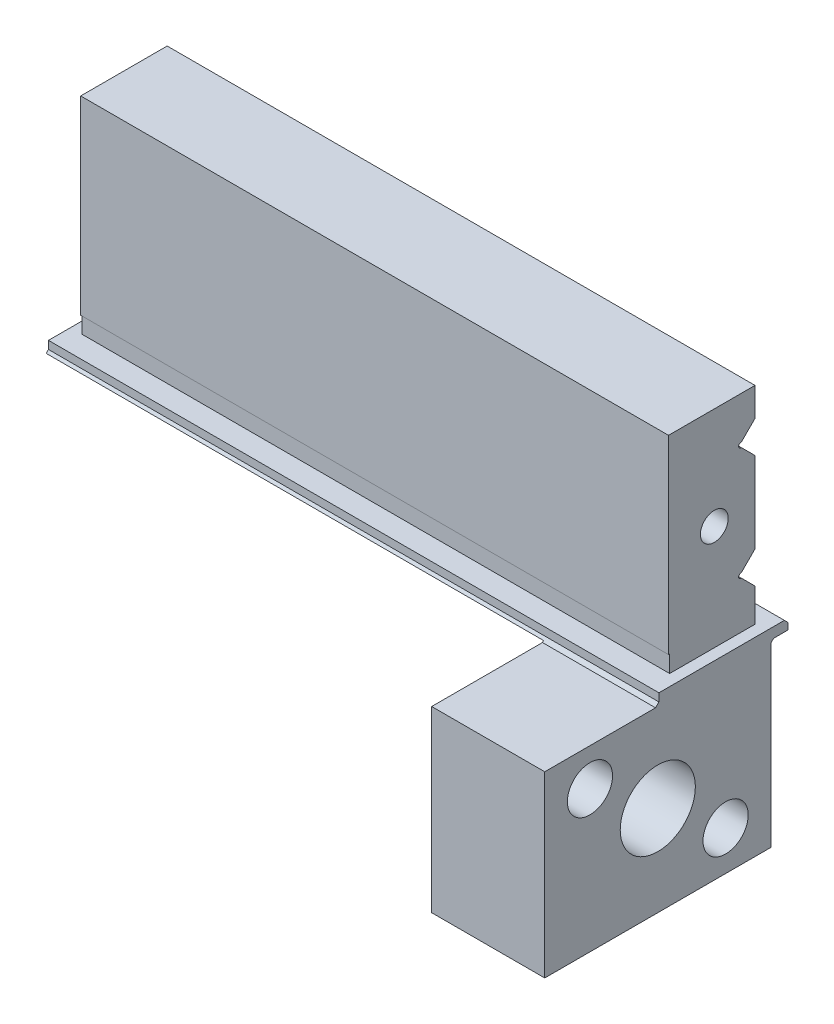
ISO-10303-21;
HEADER;
FILE_DESCRIPTION(('STEP AP214'),'2;1');
FILE_NAME('part.step','',(''),(''),'','','');
FILE_SCHEMA(('AUTOMOTIVE_DESIGN { 1 0 10303 214 1 1 1 1 }'));
ENDSEC;
DATA;
#1=APPLICATION_CONTEXT('core data for automotive mechanical design processes');
#2=APPLICATION_PROTOCOL_DEFINITION('international standard','automotive_design',2000,#1);
#3=PRODUCT_CONTEXT('',#1,'mechanical');
#4=PRODUCT('Part','Part','',(#3));
#5=PRODUCT_RELATED_PRODUCT_CATEGORY('part','',(#4));
#6=PRODUCT_DEFINITION_FORMATION('','',#4);
#7=PRODUCT_DEFINITION_CONTEXT('part definition',#1,'design');
#8=PRODUCT_DEFINITION('design','',#6,#7);
#9=PRODUCT_DEFINITION_SHAPE('','',#8);
#10=(LENGTH_UNIT() NAMED_UNIT(*) SI_UNIT(.MILLI.,.METRE.));
#11=(NAMED_UNIT(*) PLANE_ANGLE_UNIT() SI_UNIT($,.RADIAN.));
#12=(NAMED_UNIT(*) SI_UNIT($,.STERADIAN.) SOLID_ANGLE_UNIT());
#13=UNCERTAINTY_MEASURE_WITH_UNIT(LENGTH_MEASURE(1.E-05),#10,'distance_accuracy_value','');
#14=(GEOMETRIC_REPRESENTATION_CONTEXT(3) GLOBAL_UNCERTAINTY_ASSIGNED_CONTEXT((#13)) GLOBAL_UNIT_ASSIGNED_CONTEXT((#10,
#11,#12)) REPRESENTATION_CONTEXT('',''));
#15=CARTESIAN_POINT('',(0.,0.,0.));
#16=DIRECTION('',(0.,0.,1.));
#17=DIRECTION('',(1.,0.,0.));
#18=AXIS2_PLACEMENT_3D('',#15,#16,#17);
#19=CARTESIAN_POINT('',(-54.,15.9,0.85000000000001));
#20=DIRECTION('',(-1.,0.,0.));
#21=DIRECTION('',(0.,1.,0.));
#22=AXIS2_PLACEMENT_3D('',#19,#20,#21);
#23=PLANE('',#22);
#24=DIRECTION('',(0.,0.,-1.));
#25=VECTOR('',#24,1.);
#26=CARTESIAN_POINT('',(-54.,16.8,0.650000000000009));
#27=LINE('',#26,#25);
#28=CARTESIAN_POINT('',(-54.,16.8,0.650000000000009));
#29=VERTEX_POINT('',#28);
#30=CARTESIAN_POINT('',(-54.,16.8,-10.45));
#31=VERTEX_POINT('',#30);
#32=EDGE_CURVE('E225',#29,#31,#27,.T.);
#33=ORIENTED_EDGE('',*,*,#32,.T.);
#34=DIRECTION('',(0.,-0.70710678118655,-0.707106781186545));
#35=VECTOR('',#34,1.);
#36=CARTESIAN_POINT('',(-54.,16.8,-10.45));
#37=LINE('',#36,#35);
#38=CARTESIAN_POINT('',(-54.,16.5,-10.75));
#39=VERTEX_POINT('',#38);
#40=EDGE_CURVE('E213',#31,#39,#37,.T.);
#41=ORIENTED_EDGE('',*,*,#40,.T.);
#42=DIRECTION('',(0.,-1.,0.));
#43=VECTOR('',#42,1.);
#44=CARTESIAN_POINT('',(-54.,16.5,-10.75));
#45=LINE('',#44,#43);
#46=CARTESIAN_POINT('',(-54.,15.9,-10.75));
#47=VERTEX_POINT('',#46);
#48=EDGE_CURVE('E224',#39,#47,#45,.T.);
#49=ORIENTED_EDGE('',*,*,#48,.T.);
#50=DIRECTION('',(0.,0.,1.));
#51=VECTOR('',#50,1.);
#52=CARTESIAN_POINT('',(-54.,15.9,-10.75));
#53=LINE('',#52,#51);
#54=CARTESIAN_POINT('',(-54.,15.9,0.850000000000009));
#55=VERTEX_POINT('',#54);
#56=EDGE_CURVE('E248',#55,#47,#53,.F.);
#57=ORIENTED_EDGE('',*,*,#56,.F.);
#58=DIRECTION('',(0.,0.707106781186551,-0.707106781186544));
#59=VECTOR('',#58,1.);
#60=CARTESIAN_POINT('',(-54.,15.9,0.850000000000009));
#61=LINE('',#60,#59);
#62=CARTESIAN_POINT('',(-54.,16.1,0.650000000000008));
#63=VERTEX_POINT('',#62);
#64=EDGE_CURVE('E253',#55,#63,#61,.T.);
#65=ORIENTED_EDGE('',*,*,#64,.T.);
#66=DIRECTION('',(0.,1.,0.));
#67=VECTOR('',#66,1.);
#68=CARTESIAN_POINT('',(-54.,16.1,0.650000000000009));
#69=LINE('',#68,#67);
#70=EDGE_CURVE('E240',#63,#29,#69,.T.);
#71=ORIENTED_EDGE('',*,*,#70,.T.);
#72=EDGE_LOOP('',(#33,#41,#49,#57,#65,#71));
#73=FACE_BOUND('',#72,.T.);
#74=ADVANCED_FACE('F17',(#73),#23,.T.);
#75=CARTESIAN_POINT('',(-54.,15.9,-10.75));
#76=DIRECTION('',(0.,-1.,0.));
#77=DIRECTION('',(1.,0.,0.));
#78=AXIS2_PLACEMENT_3D('',#75,#76,#77);
#79=PLANE('',#78);
#80=ORIENTED_EDGE('',*,*,#56,.T.);
#81=DIRECTION('',(1.,0.,0.));
#82=VECTOR('',#81,1.);
#83=CARTESIAN_POINT('',(-54.,15.9,-10.75));
#84=LINE('',#83,#82);
#85=CARTESIAN_POINT('',(0.,15.9,-10.75));
#86=VERTEX_POINT('',#85);
#87=EDGE_CURVE('E260',#47,#86,#84,.T.);
#88=ORIENTED_EDGE('',*,*,#87,.T.);
#89=DIRECTION('',(0.,0.,1.));
#90=VECTOR('',#89,1.);
#91=CARTESIAN_POINT('',(0.,15.9,-10.75));
#92=LINE('',#91,#90);
#93=CARTESIAN_POINT('',(0.,15.9,-9.65));
#94=VERTEX_POINT('',#93);
#95=EDGE_CURVE('E265',#86,#94,#92,.T.);
#96=ORIENTED_EDGE('',*,*,#95,.T.);
#97=DIRECTION('',(-1.,0.,0.));
#98=VECTOR('',#97,1.);
#99=CARTESIAN_POINT('',(0.,15.9,-9.65));
#100=LINE('',#99,#98);
#101=CARTESIAN_POINT('',(-9.99999999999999,15.9,-9.65));
#102=VERTEX_POINT('',#101);
#103=EDGE_CURVE('E270',#102,#94,#100,.F.);
#104=ORIENTED_EDGE('',*,*,#103,.F.);
#105=DIRECTION('',(0.,0.,1.));
#106=VECTOR('',#105,1.);
#107=CARTESIAN_POINT('',(-9.99999999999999,15.9,-9.65));
#108=LINE('',#107,#106);
#109=CARTESIAN_POINT('',(-9.99999999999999,15.9,0.85));
#110=VERTEX_POINT('',#109);
#111=EDGE_CURVE('E274',#110,#102,#108,.F.);
#112=ORIENTED_EDGE('',*,*,#111,.F.);
#113=DIRECTION('',(-1.,0.,0.));
#114=VECTOR('',#113,1.);
#115=CARTESIAN_POINT('',(-9.99999999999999,15.9,0.85000000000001));
#116=LINE('',#115,#114);
#117=EDGE_CURVE('E279',#110,#55,#116,.T.);
#118=ORIENTED_EDGE('',*,*,#117,.T.);
#119=EDGE_LOOP('',(#80,#88,#96,#104,#112,#118));
#120=FACE_BOUND('',#119,.T.);
#121=ADVANCED_FACE('F689',(#120),#79,.T.);
#122=CARTESIAN_POINT('',(-10.,0.,10.75));
#123=DIRECTION('',(-1.,0.,0.));
#124=DIRECTION('',(0.,1.,0.));
#125=AXIS2_PLACEMENT_3D('',#122,#123,#124);
#126=PLANE('',#125);
#127=ORIENTED_EDGE('',*,*,#111,.T.);
#128=CARTESIAN_POINT('',(-10.,15.5000000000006,-9.64999999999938));
#129=DIRECTION('',(1.,0.,0.));
#130=DIRECTION('',(0.,1.,-1.54543045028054E-12));
#131=AXIS2_PLACEMENT_3D('',#128,#129,#130);
#132=CIRCLE('',#131,0.39999999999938);
#133=CARTESIAN_POINT('',(-10.,15.5000000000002,-9.25));
#134=VERTEX_POINT('',#133);
#135=EDGE_CURVE('E284',#102,#134,#132,.T.);
#136=ORIENTED_EDGE('',*,*,#135,.T.);
#137=DIRECTION('',(0.,-1.,0.));
#138=VECTOR('',#137,1.);
#139=CARTESIAN_POINT('',(-10.,15.5000000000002,-9.25));
#140=LINE('',#139,#138);
#141=CARTESIAN_POINT('',(-10.,0.,-9.25));
#142=VERTEX_POINT('',#141);
#143=EDGE_CURVE('E289',#134,#142,#140,.T.);
#144=ORIENTED_EDGE('',*,*,#143,.T.);
#145=DIRECTION('',(0.,0.,1.));
#146=VECTOR('',#145,1.);
#147=CARTESIAN_POINT('',(-10.,0.,-9.25));
#148=LINE('',#147,#146);
#149=CARTESIAN_POINT('',(-10.,0.,10.75));
#150=VERTEX_POINT('',#149);
#151=EDGE_CURVE('E294',#150,#142,#148,.F.);
#152=ORIENTED_EDGE('',*,*,#151,.F.);
#153=DIRECTION('',(0.,1.,0.));
#154=VECTOR('',#153,1.);
#155=CARTESIAN_POINT('',(-10.,0.,10.75));
#156=LINE('',#155,#154);
#157=CARTESIAN_POINT('',(-10.,15.8,10.75));
#158=VERTEX_POINT('',#157);
#159=EDGE_CURVE('E299',#158,#150,#156,.F.);
#160=ORIENTED_EDGE('',*,*,#159,.F.);
#161=DIRECTION('',(0.,0.,-1.));
#162=VECTOR('',#161,1.);
#163=CARTESIAN_POINT('',(-10.,15.8,10.75));
#164=LINE('',#163,#162);
#165=CARTESIAN_POINT('',(-10.,15.8,0.949999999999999));
#166=VERTEX_POINT('',#165);
#167=EDGE_CURVE('E303',#158,#166,#164,.T.);
#168=ORIENTED_EDGE('',*,*,#167,.T.);
#169=DIRECTION('',(0.,0.70710678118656,-0.707106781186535));
#170=VECTOR('',#169,1.);
#171=CARTESIAN_POINT('',(-10.,15.8,0.949999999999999));
#172=LINE('',#171,#170);
#173=EDGE_CURVE('E308',#166,#110,#172,.T.);
#174=ORIENTED_EDGE('',*,*,#173,.T.);
#175=EDGE_LOOP('',(#127,#136,#144,#152,#160,#168,#174));
#176=FACE_BOUND('',#175,.T.);
#177=CARTESIAN_POINT('',(-10.,8.,0.75));
#178=DIRECTION('',(1.,0.,0.));
#179=DIRECTION('',(0.,-1.42053885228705E-07,0.99999999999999));
#180=AXIS2_PLACEMENT_3D('',#177,#178,#179);
#181=CIRCLE('',#180,3.3235);
#182=CARTESIAN_POINT('',(-10.,7.99999952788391,4.07349999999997));
#183=VERTEX_POINT('',#182);
#184=EDGE_CURVE('E313',#183,#183,#181,.T.);
#185=ORIENTED_EDGE('',*,*,#184,.T.);
#186=EDGE_LOOP('',(#185));
#187=FACE_BOUND('',#186,.T.);
#188=CARTESIAN_POINT('',(-10.,12.5,6.75));
#189=DIRECTION('',(1.,0.,0.));
#190=DIRECTION('',(0.,-1.42053863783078E-07,0.99999999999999));
#191=AXIS2_PLACEMENT_3D('',#188,#189,#190);
#192=CIRCLE('',#191,2.);
#193=CARTESIAN_POINT('',(-10.,12.4999997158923,8.74999999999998));
#194=VERTEX_POINT('',#193);
#195=EDGE_CURVE('E318',#194,#194,#192,.T.);
#196=ORIENTED_EDGE('',*,*,#195,.T.);
#197=EDGE_LOOP('',(#196));
#198=FACE_BOUND('',#197,.T.);
#199=CARTESIAN_POINT('',(-10.,3.5,-5.25));
#200=DIRECTION('',(1.,0.,0.));
#201=DIRECTION('',(0.,0.,1.));
#202=AXIS2_PLACEMENT_3D('',#199,#200,#201);
#203=CIRCLE('',#202,2.);
#204=CARTESIAN_POINT('',(-10.,3.5,-3.25));
#205=VERTEX_POINT('',#204);
#206=EDGE_CURVE('E321',#205,#205,#203,.T.);
#207=ORIENTED_EDGE('',*,*,#206,.T.);
#208=EDGE_LOOP('',(#207));
#209=FACE_BOUND('',#208,.T.);
#210=ADVANCED_FACE('F694',(#176,#187,#198,#209),#126,.T.);
#211=CARTESIAN_POINT('',(-10.,0.,-9.25));
#212=DIRECTION('',(0.,-1.,0.));
#213=DIRECTION('',(1.,0.,0.));
#214=AXIS2_PLACEMENT_3D('',#211,#212,#213);
#215=PLANE('',#214);
#216=ORIENTED_EDGE('',*,*,#151,.T.);
#217=DIRECTION('',(1.,0.,0.));
#218=VECTOR('',#217,1.);
#219=CARTESIAN_POINT('',(-10.,0.,-9.25));
#220=LINE('',#219,#218);
#221=CARTESIAN_POINT('',(0.,0.,-9.25));
#222=VERTEX_POINT('',#221);
#223=EDGE_CURVE('E324',#142,#222,#220,.T.);
#224=ORIENTED_EDGE('',*,*,#223,.T.);
#225=DIRECTION('',(0.,0.,1.));
#226=VECTOR('',#225,1.);
#227=CARTESIAN_POINT('',(0.,0.,-9.25));
#228=LINE('',#227,#226);
#229=CARTESIAN_POINT('',(0.,0.,10.75));
#230=VERTEX_POINT('',#229);
#231=EDGE_CURVE('E327',#230,#222,#228,.F.);
#232=ORIENTED_EDGE('',*,*,#231,.F.);
#233=DIRECTION('',(-1.,0.,0.));
#234=VECTOR('',#233,1.);
#235=CARTESIAN_POINT('',(0.,0.,10.75));
#236=LINE('',#235,#234);
#237=EDGE_CURVE('E332',#150,#230,#236,.F.);
#238=ORIENTED_EDGE('',*,*,#237,.F.);
#239=EDGE_LOOP('',(#216,#224,#232,#238));
#240=FACE_BOUND('',#239,.T.);
#241=ADVANCED_FACE('F700',(#240),#215,.T.);
#242=CARTESIAN_POINT('',(0.,0.,-10.75));
#243=DIRECTION('',(1.,0.,0.));
#244=DIRECTION('',(0.,1.,0.));
#245=AXIS2_PLACEMENT_3D('',#242,#243,#244);
#246=PLANE('',#245);
#247=DIRECTION('',(0.,1.,0.));
#248=VECTOR('',#247,1.);
#249=CARTESIAN_POINT('',(0.,15.9,-10.75));
#250=LINE('',#249,#248);
#251=CARTESIAN_POINT('',(0.,16.5,-10.75));
#252=VERTEX_POINT('',#251);
#253=EDGE_CURVE('E336',#86,#252,#250,.T.);
#254=ORIENTED_EDGE('',*,*,#253,.T.);
#255=DIRECTION('',(0.,0.707106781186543,0.707106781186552));
#256=VECTOR('',#255,1.);
#257=CARTESIAN_POINT('',(0.,16.5,-10.75));
#258=LINE('',#257,#256);
#259=CARTESIAN_POINT('',(0.,16.8,-10.45));
#260=VERTEX_POINT('',#259);
#261=EDGE_CURVE('E341',#260,#252,#258,.F.);
#262=ORIENTED_EDGE('',*,*,#261,.F.);
#263=DIRECTION('',(0.,0.,1.));
#264=VECTOR('',#263,1.);
#265=CARTESIAN_POINT('',(0.,16.8,-10.45));
#266=LINE('',#265,#264);
#267=CARTESIAN_POINT('',(0.,16.8,0.650000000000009));
#268=VERTEX_POINT('',#267);
#269=EDGE_CURVE('E234',#268,#260,#266,.F.);
#270=ORIENTED_EDGE('',*,*,#269,.F.);
#271=DIRECTION('',(0.,-1.,0.));
#272=VECTOR('',#271,1.);
#273=CARTESIAN_POINT('',(0.,16.8,0.650000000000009));
#274=LINE('',#273,#272);
#275=CARTESIAN_POINT('',(0.,16.1,0.650000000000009));
#276=VERTEX_POINT('',#275);
#277=EDGE_CURVE('E348',#276,#268,#274,.F.);
#278=ORIENTED_EDGE('',*,*,#277,.F.);
#279=DIRECTION('',(0.,-0.707106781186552,0.707106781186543));
#280=VECTOR('',#279,1.);
#281=CARTESIAN_POINT('',(0.,16.1,0.650000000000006));
#282=LINE('',#281,#280);
#283=CARTESIAN_POINT('',(0.,15.8,0.949999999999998));
#284=VERTEX_POINT('',#283);
#285=EDGE_CURVE('E352',#284,#276,#282,.F.);
#286=ORIENTED_EDGE('',*,*,#285,.F.);
#287=DIRECTION('',(0.,0.,1.));
#288=VECTOR('',#287,1.);
#289=CARTESIAN_POINT('',(0.,15.8,0.949999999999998));
#290=LINE('',#289,#288);
#291=CARTESIAN_POINT('',(0.,15.8,10.75));
#292=VERTEX_POINT('',#291);
#293=EDGE_CURVE('E357',#292,#284,#290,.F.);
#294=ORIENTED_EDGE('',*,*,#293,.F.);
#295=DIRECTION('',(0.,-1.,0.));
#296=VECTOR('',#295,1.);
#297=CARTESIAN_POINT('',(0.,15.8,10.75));
#298=LINE('',#297,#296);
#299=EDGE_CURVE('E361',#230,#292,#298,.F.);
#300=ORIENTED_EDGE('',*,*,#299,.F.);
#301=ORIENTED_EDGE('',*,*,#231,.T.);
#302=DIRECTION('',(0.,1.,0.));
#303=VECTOR('',#302,1.);
#304=CARTESIAN_POINT('',(0.,0.,-9.25));
#305=LINE('',#304,#303);
#306=CARTESIAN_POINT('',(0.,15.5,-9.25));
#307=VERTEX_POINT('',#306);
#308=EDGE_CURVE('E366',#307,#222,#305,.F.);
#309=ORIENTED_EDGE('',*,*,#308,.F.);
#310=CARTESIAN_POINT('',(0.,15.5000000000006,-9.64999999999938));
#311=DIRECTION('',(-1.,0.,0.));
#312=DIRECTION('',(0.,-1.44328993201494E-12,1.));
#313=AXIS2_PLACEMENT_3D('',#310,#311,#312);
#314=CIRCLE('',#313,0.39999999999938);
#315=EDGE_CURVE('E370',#94,#307,#314,.F.);
#316=ORIENTED_EDGE('',*,*,#315,.F.);
#317=ORIENTED_EDGE('',*,*,#95,.F.);
#318=EDGE_LOOP('',(#254,#262,#270,#278,#286,#294,#300,#301,#309,#316,#317));
#319=FACE_BOUND('',#318,.T.);
#320=CARTESIAN_POINT('',(0.,8.,0.75));
#321=DIRECTION('',(-1.,0.,0.));
#322=DIRECTION('',(0.,0.,-1.));
#323=AXIS2_PLACEMENT_3D('',#320,#321,#322);
#324=CIRCLE('',#323,3.3235);
#325=CARTESIAN_POINT('',(0.,8.,-2.5735));
#326=VERTEX_POINT('',#325);
#327=EDGE_CURVE('E375',#326,#326,#324,.F.);
#328=ORIENTED_EDGE('',*,*,#327,.F.);
#329=EDGE_LOOP('',(#328));
#330=FACE_BOUND('',#329,.T.);
#331=CARTESIAN_POINT('',(0.,12.5,6.75));
#332=DIRECTION('',(-1.,0.,0.));
#333=DIRECTION('',(0.,0.,-1.));
#334=AXIS2_PLACEMENT_3D('',#331,#332,#333);
#335=CIRCLE('',#334,2.);
#336=CARTESIAN_POINT('',(0.,12.5,4.75));
#337=VERTEX_POINT('',#336);
#338=EDGE_CURVE('E380',#337,#337,#335,.F.);
#339=ORIENTED_EDGE('',*,*,#338,.F.);
#340=EDGE_LOOP('',(#339));
#341=FACE_BOUND('',#340,.T.);
#342=CARTESIAN_POINT('',(0.,3.5,-5.25));
#343=DIRECTION('',(-1.,0.,0.));
#344=DIRECTION('',(0.,0.,-1.));
#345=AXIS2_PLACEMENT_3D('',#342,#343,#344);
#346=CIRCLE('',#345,2.);
#347=CARTESIAN_POINT('',(0.,3.5,-7.25));
#348=VERTEX_POINT('',#347);
#349=EDGE_CURVE('E236',#348,#348,#346,.F.);
#350=ORIENTED_EDGE('',*,*,#349,.F.);
#351=EDGE_LOOP('',(#350));
#352=FACE_BOUND('',#351,.T.);
#353=ADVANCED_FACE('F704',(#319,#330,#341,#352),#246,.T.);
#354=CARTESIAN_POINT('',(-54.,16.8,0.650000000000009));
#355=DIRECTION('',(0.,1.,0.));
#356=DIRECTION('',(1.,0.,0.));
#357=AXIS2_PLACEMENT_3D('',#354,#355,#356);
#358=PLANE('',#357);
#359=ORIENTED_EDGE('',*,*,#269,.T.);
#360=DIRECTION('',(-1.,0.,0.));
#361=VECTOR('',#360,1.);
#362=CARTESIAN_POINT('',(0.,16.8,-10.45));
#363=LINE('',#362,#361);
#364=EDGE_CURVE('E216',#31,#260,#363,.F.);
#365=ORIENTED_EDGE('',*,*,#364,.F.);
#366=ORIENTED_EDGE('',*,*,#32,.F.);
#367=DIRECTION('',(1.,0.,0.));
#368=VECTOR('',#367,1.);
#369=CARTESIAN_POINT('',(-54.,16.8,0.650000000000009));
#370=LINE('',#369,#368);
#371=EDGE_CURVE('E235',#29,#268,#370,.T.);
#372=ORIENTED_EDGE('',*,*,#371,.T.);
#373=EDGE_LOOP('',(#359,#365,#366,#372));
#374=FACE_BOUND('',#373,.T.);
#375=DIRECTION('',(1.,0.,0.));
#376=VECTOR('',#375,1.);
#377=CARTESIAN_POINT('',(-53.,16.8,-8.85));
#378=LINE('',#377,#376);
#379=CARTESIAN_POINT('',(-53.,16.8,-8.85));
#380=VERTEX_POINT('',#379);
#381=CARTESIAN_POINT('',(-1.,16.8,-8.85));
#382=VERTEX_POINT('',#381);
#383=EDGE_CURVE('E388',#380,#382,#378,.T.);
#384=ORIENTED_EDGE('',*,*,#383,.T.);
#385=DIRECTION('',(0.,0.,1.));
#386=VECTOR('',#385,1.);
#387=CARTESIAN_POINT('',(-1.,16.8,-8.85));
#388=LINE('',#387,#386);
#389=CARTESIAN_POINT('',(-1.,16.8,-1.3));
#390=VERTEX_POINT('',#389);
#391=EDGE_CURVE('E393',#390,#382,#388,.F.);
#392=ORIENTED_EDGE('',*,*,#391,.F.);
#393=DIRECTION('',(-1.,0.,0.));
#394=VECTOR('',#393,1.);
#395=CARTESIAN_POINT('',(-1.,16.8,-1.3));
#396=LINE('',#395,#394);
#397=CARTESIAN_POINT('',(-53.,16.8,-1.3));
#398=VERTEX_POINT('',#397);
#399=EDGE_CURVE('E398',#398,#390,#396,.F.);
#400=ORIENTED_EDGE('',*,*,#399,.F.);
#401=DIRECTION('',(0.,0.,-1.));
#402=VECTOR('',#401,1.);
#403=CARTESIAN_POINT('',(-53.,16.8,-1.3));
#404=LINE('',#403,#402);
#405=EDGE_CURVE('E402',#398,#380,#404,.T.);
#406=ORIENTED_EDGE('',*,*,#405,.T.);
#407=EDGE_LOOP('',(#384,#392,#400,#406));
#408=FACE_BOUND('',#407,.T.);
#409=ADVANCED_FACE('F230',(#374,#408),#358,.T.);
#410=CARTESIAN_POINT('',(-1.,16.8,-8.85000000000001));
#411=DIRECTION('',(1.,0.,0.));
#412=DIRECTION('',(0.,1.,0.));
#413=AXIS2_PLACEMENT_3D('',#410,#411,#412);
#414=PLANE('',#413);
#415=ORIENTED_EDGE('',*,*,#391,.T.);
#416=DIRECTION('',(0.,1.,0.));
#417=VECTOR('',#416,1.);
#418=CARTESIAN_POINT('',(-1.,16.8,-8.85));
#419=LINE('',#418,#417);
#420=CARTESIAN_POINT('',(-1.,19.73,-8.85));
#421=VERTEX_POINT('',#420);
#422=EDGE_CURVE('E407',#382,#421,#419,.T.);
#423=ORIENTED_EDGE('',*,*,#422,.T.);
#424=DIRECTION('',(0.,0.707106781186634,0.707106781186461));
#425=VECTOR('',#424,1.);
#426=CARTESIAN_POINT('',(-1.,19.73,-8.85000000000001));
#427=LINE('',#426,#425);
#428=CARTESIAN_POINT('',(-1.,20.937123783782,-7.64287621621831));
#429=VERTEX_POINT('',#428);
#430=EDGE_CURVE('E412',#421,#429,#427,.T.);
#431=ORIENTED_EDGE('',*,*,#430,.T.);
#432=DIRECTION('',(0.,0.199999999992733,0.979795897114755));
#433=VECTOR('',#432,1.);
#434=CARTESIAN_POINT('',(-1.,20.937123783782,-7.64287621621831));
#435=LINE('',#434,#433);
#436=CARTESIAN_POINT('',(-1.,20.954040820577,-7.56));
#437=VERTEX_POINT('',#436);
#438=EDGE_CURVE('E417',#429,#437,#435,.T.);
#439=ORIENTED_EDGE('',*,*,#438,.T.);
#440=CARTESIAN_POINT('',(-1.,21.15,-7.60000000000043));
#441=DIRECTION('',(-1.,0.,0.));
#442=DIRECTION('',(0.,-0.979795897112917,0.200000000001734));
#443=AXIS2_PLACEMENT_3D('',#440,#441,#442);
#444=CIRCLE('',#443,0.200000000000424);
#445=CARTESIAN_POINT('',(-1.,21.345959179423,-7.56));
#446=VERTEX_POINT('',#445);
#447=EDGE_CURVE('E422',#437,#446,#444,.T.);
#448=ORIENTED_EDGE('',*,*,#447,.T.);
#449=DIRECTION('',(0.,0.199999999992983,-0.979795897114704));
#450=VECTOR('',#449,1.);
#451=CARTESIAN_POINT('',(-1.,21.345959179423,-7.56));
#452=LINE('',#451,#450);
#453=CARTESIAN_POINT('',(-1.,21.362876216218,-7.6428762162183));
#454=VERTEX_POINT('',#453);
#455=EDGE_CURVE('E427',#446,#454,#452,.T.);
#456=ORIENTED_EDGE('',*,*,#455,.T.);
#457=DIRECTION('',(0.,0.707106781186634,-0.707106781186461));
#458=VECTOR('',#457,1.);
#459=CARTESIAN_POINT('',(-1.,21.362876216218,-7.6428762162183));
#460=LINE('',#459,#458);
#461=CARTESIAN_POINT('',(-1.,22.57,-8.85));
#462=VERTEX_POINT('',#461);
#463=EDGE_CURVE('E432',#454,#462,#460,.T.);
#464=ORIENTED_EDGE('',*,*,#463,.T.);
#465=DIRECTION('',(0.,1.,0.));
#466=VECTOR('',#465,1.);
#467=CARTESIAN_POINT('',(-1.,22.57,-8.85));
#468=LINE('',#467,#466);
#469=CARTESIAN_POINT('',(-1.,29.73,-8.85));
#470=VERTEX_POINT('',#469);
#471=EDGE_CURVE('E437',#462,#470,#468,.T.);
#472=ORIENTED_EDGE('',*,*,#471,.T.);
#473=DIRECTION('',(0.,0.707106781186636,0.707106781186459));
#474=VECTOR('',#473,1.);
#475=CARTESIAN_POINT('',(-1.,29.73,-8.85));
#476=LINE('',#475,#474);
#477=CARTESIAN_POINT('',(-1.,30.937123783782,-7.6428762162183));
#478=VERTEX_POINT('',#477);
#479=EDGE_CURVE('E442',#470,#478,#476,.T.);
#480=ORIENTED_EDGE('',*,*,#479,.T.);
#481=DIRECTION('',(0.,0.199999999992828,0.979795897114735));
#482=VECTOR('',#481,1.);
#483=CARTESIAN_POINT('',(-1.,30.937123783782,-7.6428762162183));
#484=LINE('',#483,#482);
#485=CARTESIAN_POINT('',(-1.,30.954040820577,-7.56));
#486=VERTEX_POINT('',#485);
#487=EDGE_CURVE('E447',#478,#486,#484,.T.);
#488=ORIENTED_EDGE('',*,*,#487,.T.);
#489=CARTESIAN_POINT('',(-1.,31.15,-7.60000000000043));
#490=DIRECTION('',(-1.,0.,0.));
#491=DIRECTION('',(0.,-0.979795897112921,0.200000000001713));
#492=AXIS2_PLACEMENT_3D('',#489,#490,#491);
#493=CIRCLE('',#492,0.200000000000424);
#494=CARTESIAN_POINT('',(-1.,31.345959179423,-7.56));
#495=VERTEX_POINT('',#494);
#496=EDGE_CURVE('E452',#486,#495,#493,.T.);
#497=ORIENTED_EDGE('',*,*,#496,.T.);
#498=DIRECTION('',(0.,0.199999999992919,-0.979795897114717));
#499=VECTOR('',#498,1.);
#500=CARTESIAN_POINT('',(-1.,31.345959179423,-7.56000000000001));
#501=LINE('',#500,#499);
#502=CARTESIAN_POINT('',(-1.,31.362876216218,-7.6428762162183));
#503=VERTEX_POINT('',#502);
#504=EDGE_CURVE('E457',#495,#503,#501,.T.);
#505=ORIENTED_EDGE('',*,*,#504,.T.);
#506=DIRECTION('',(0.,0.707106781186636,-0.707106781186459));
#507=VECTOR('',#506,1.);
#508=CARTESIAN_POINT('',(-1.,31.362876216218,-7.6428762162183));
#509=LINE('',#508,#507);
#510=CARTESIAN_POINT('',(-1.,32.57,-8.85));
#511=VERTEX_POINT('',#510);
#512=EDGE_CURVE('E462',#503,#511,#509,.T.);
#513=ORIENTED_EDGE('',*,*,#512,.T.);
#514=DIRECTION('',(0.,1.,0.));
#515=VECTOR('',#514,1.);
#516=CARTESIAN_POINT('',(-1.,32.57,-8.85));
#517=LINE('',#516,#515);
#518=CARTESIAN_POINT('',(-1.,35.1,-8.85));
#519=VERTEX_POINT('',#518);
#520=EDGE_CURVE('E467',#511,#519,#517,.T.);
#521=ORIENTED_EDGE('',*,*,#520,.T.);
#522=DIRECTION('',(0.,0.,1.));
#523=VECTOR('',#522,1.);
#524=CARTESIAN_POINT('',(-1.,35.1,-8.85));
#525=LINE('',#524,#523);
#526=CARTESIAN_POINT('',(-1.,35.1,-1.2));
#527=VERTEX_POINT('',#526);
#528=EDGE_CURVE('E472',#527,#519,#525,.F.);
#529=ORIENTED_EDGE('',*,*,#528,.F.);
#530=DIRECTION('',(0.,-1.,0.));
#531=VECTOR('',#530,1.);
#532=CARTESIAN_POINT('',(-1.,35.1,-1.2));
#533=LINE('',#532,#531);
#534=CARTESIAN_POINT('',(-1.,18.3,-1.2));
#535=VERTEX_POINT('',#534);
#536=EDGE_CURVE('E477',#527,#535,#533,.T.);
#537=ORIENTED_EDGE('',*,*,#536,.T.);
#538=DIRECTION('',(0.,0.,-1.));
#539=VECTOR('',#538,1.);
#540=CARTESIAN_POINT('',(-1.,18.3,-1.2));
#541=LINE('',#540,#539);
#542=CARTESIAN_POINT('',(-1.,18.3,-1.3));
#543=VERTEX_POINT('',#542);
#544=EDGE_CURVE('E482',#535,#543,#541,.T.);
#545=ORIENTED_EDGE('',*,*,#544,.T.);
#546=DIRECTION('',(0.,-1.,0.));
#547=VECTOR('',#546,1.);
#548=CARTESIAN_POINT('',(-1.,18.3,-1.3));
#549=LINE('',#548,#547);
#550=EDGE_CURVE('E487',#543,#390,#549,.T.);
#551=ORIENTED_EDGE('',*,*,#550,.T.);
#552=EDGE_LOOP('',(#415,#423,#431,#439,#448,#456,#464,#472,#480,#488,#497,#505,#513,#521,#529,
#537,#545,#551));
#553=FACE_BOUND('',#552,.T.);
#554=CARTESIAN_POINT('',(-1.,26.1,-5.25));
#555=DIRECTION('',(-1.,0.,0.));
#556=DIRECTION('',(0.,0.,-1.));
#557=AXIS2_PLACEMENT_3D('',#554,#555,#556);
#558=CIRCLE('',#557,1.2295);
#559=CARTESIAN_POINT('',(-1.,26.1,-6.4795));
#560=VERTEX_POINT('',#559);
#561=EDGE_CURVE('E492',#560,#560,#558,.F.);
#562=ORIENTED_EDGE('',*,*,#561,.F.);
#563=EDGE_LOOP('',(#562));
#564=FACE_BOUND('',#563,.T.);
#565=ADVANCED_FACE('F711',(#553,#564),#414,.T.);
#566=CARTESIAN_POINT('',(-53.,35.1,-1.2));
#567=DIRECTION('',(0.,1.,0.));
#568=DIRECTION('',(1.,0.,0.));
#569=AXIS2_PLACEMENT_3D('',#566,#567,#568);
#570=PLANE('',#569);
#571=ORIENTED_EDGE('',*,*,#528,.T.);
#572=DIRECTION('',(-1.,0.,0.));
#573=VECTOR('',#572,1.);
#574=CARTESIAN_POINT('',(-1.,35.1,-8.85));
#575=LINE('',#574,#573);
#576=CARTESIAN_POINT('',(-53.,35.1,-8.85));
#577=VERTEX_POINT('',#576);
#578=EDGE_CURVE('E497',#577,#519,#575,.F.);
#579=ORIENTED_EDGE('',*,*,#578,.F.);
#580=DIRECTION('',(0.,0.,1.));
#581=VECTOR('',#580,1.);
#582=CARTESIAN_POINT('',(-53.,35.1,-8.85));
#583=LINE('',#582,#581);
#584=CARTESIAN_POINT('',(-53.,35.1,-1.2));
#585=VERTEX_POINT('',#584);
#586=EDGE_CURVE('E499',#585,#577,#583,.F.);
#587=ORIENTED_EDGE('',*,*,#586,.F.);
#588=DIRECTION('',(1.,0.,0.));
#589=VECTOR('',#588,1.);
#590=CARTESIAN_POINT('',(-53.,35.1,-1.2));
#591=LINE('',#590,#589);
#592=EDGE_CURVE('E504',#585,#527,#591,.T.);
#593=ORIENTED_EDGE('',*,*,#592,.T.);
#594=EDGE_LOOP('',(#571,#579,#587,#593));
#595=FACE_BOUND('',#594,.T.);
#596=ADVANCED_FACE('F714',(#595),#570,.T.);
#597=CARTESIAN_POINT('',(-53.,16.8,-1.2));
#598=DIRECTION('',(-1.,0.,0.));
#599=DIRECTION('',(0.,1.,0.));
#600=AXIS2_PLACEMENT_3D('',#597,#598,#599);
#601=PLANE('',#600);
#602=DIRECTION('',(0.,-0.707106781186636,-0.707106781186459));
#603=VECTOR('',#602,1.);
#604=CARTESIAN_POINT('',(-53.,20.937123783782,-7.6428762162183));
#605=LINE('',#604,#603);
#606=CARTESIAN_POINT('',(-53.,20.937123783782,-7.6428762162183));
#607=VERTEX_POINT('',#606);
#608=CARTESIAN_POINT('',(-53.,19.73,-8.85));
#609=VERTEX_POINT('',#608);
#610=EDGE_CURVE('E509',#607,#609,#605,.T.);
#611=ORIENTED_EDGE('',*,*,#610,.T.);
#612=DIRECTION('',(0.,-1.,0.));
#613=VECTOR('',#612,1.);
#614=CARTESIAN_POINT('',(-53.,19.73,-8.85));
#615=LINE('',#614,#613);
#616=EDGE_CURVE('E514',#609,#380,#615,.T.);
#617=ORIENTED_EDGE('',*,*,#616,.T.);
#618=ORIENTED_EDGE('',*,*,#405,.F.);
#619=DIRECTION('',(0.,1.,0.));
#620=VECTOR('',#619,1.);
#621=CARTESIAN_POINT('',(-53.,16.8,-1.3));
#622=LINE('',#621,#620);
#623=CARTESIAN_POINT('',(-53.,18.3,-1.3));
#624=VERTEX_POINT('',#623);
#625=EDGE_CURVE('E519',#398,#624,#622,.T.);
#626=ORIENTED_EDGE('',*,*,#625,.T.);
#627=DIRECTION('',(0.,0.,1.));
#628=VECTOR('',#627,1.);
#629=CARTESIAN_POINT('',(-53.,18.3,-1.3));
#630=LINE('',#629,#628);
#631=CARTESIAN_POINT('',(-53.,18.3,-1.2));
#632=VERTEX_POINT('',#631);
#633=EDGE_CURVE('E524',#624,#632,#630,.T.);
#634=ORIENTED_EDGE('',*,*,#633,.T.);
#635=DIRECTION('',(0.,1.,0.));
#636=VECTOR('',#635,1.);
#637=CARTESIAN_POINT('',(-53.,18.3,-1.2));
#638=LINE('',#637,#636);
#639=EDGE_CURVE('E529',#632,#585,#638,.T.);
#640=ORIENTED_EDGE('',*,*,#639,.T.);
#641=ORIENTED_EDGE('',*,*,#586,.T.);
#642=DIRECTION('',(0.,-1.,0.));
#643=VECTOR('',#642,1.);
#644=CARTESIAN_POINT('',(-53.,35.1,-8.85));
#645=LINE('',#644,#643);
#646=CARTESIAN_POINT('',(-53.,32.57,-8.85));
#647=VERTEX_POINT('',#646);
#648=EDGE_CURVE('E534',#577,#647,#645,.T.);
#649=ORIENTED_EDGE('',*,*,#648,.T.);
#650=DIRECTION('',(0.,-0.707106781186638,0.707106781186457));
#651=VECTOR('',#650,1.);
#652=CARTESIAN_POINT('',(-53.,32.57,-8.85000000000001));
#653=LINE('',#652,#651);
#654=CARTESIAN_POINT('',(-53.,31.362876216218,-7.64287621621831));
#655=VERTEX_POINT('',#654);
#656=EDGE_CURVE('E539',#647,#655,#653,.T.);
#657=ORIENTED_EDGE('',*,*,#656,.T.);
#658=DIRECTION('',(0.,-0.199999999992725,0.979795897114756));
#659=VECTOR('',#658,1.);
#660=CARTESIAN_POINT('',(-53.,31.362876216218,-7.64287621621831));
#661=LINE('',#660,#659);
#662=CARTESIAN_POINT('',(-53.,31.345959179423,-7.56));
#663=VERTEX_POINT('',#662);
#664=EDGE_CURVE('E544',#655,#663,#661,.T.);
#665=ORIENTED_EDGE('',*,*,#664,.T.);
#666=CARTESIAN_POINT('',(-53.,31.15,-7.60000000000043));
#667=DIRECTION('',(1.,0.,0.));
#668=DIRECTION('',(0.,0.979795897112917,0.200000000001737));
#669=AXIS2_PLACEMENT_3D('',#666,#667,#668);
#670=CIRCLE('',#669,0.200000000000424);
#671=CARTESIAN_POINT('',(-53.,30.954040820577,-7.56));
#672=VERTEX_POINT('',#671);
#673=EDGE_CURVE('E549',#663,#672,#670,.T.);
#674=ORIENTED_EDGE('',*,*,#673,.T.);
#675=DIRECTION('',(0.,-0.199999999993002,-0.9797958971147));
#676=VECTOR('',#675,1.);
#677=CARTESIAN_POINT('',(-53.,30.954040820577,-7.56));
#678=LINE('',#677,#676);
#679=CARTESIAN_POINT('',(-53.,30.937123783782,-7.6428762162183));
#680=VERTEX_POINT('',#679);
#681=EDGE_CURVE('E554',#672,#680,#678,.T.);
#682=ORIENTED_EDGE('',*,*,#681,.T.);
#683=DIRECTION('',(0.,-0.707106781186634,-0.707106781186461));
#684=VECTOR('',#683,1.);
#685=CARTESIAN_POINT('',(-53.,30.937123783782,-7.6428762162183));
#686=LINE('',#685,#684);
#687=CARTESIAN_POINT('',(-53.,29.73,-8.85));
#688=VERTEX_POINT('',#687);
#689=EDGE_CURVE('E559',#680,#688,#686,.T.);
#690=ORIENTED_EDGE('',*,*,#689,.T.);
#691=DIRECTION('',(0.,-1.,0.));
#692=VECTOR('',#691,1.);
#693=CARTESIAN_POINT('',(-53.,29.73,-8.85));
#694=LINE('',#693,#692);
#695=CARTESIAN_POINT('',(-53.,22.57,-8.85));
#696=VERTEX_POINT('',#695);
#697=EDGE_CURVE('E564',#688,#696,#694,.T.);
#698=ORIENTED_EDGE('',*,*,#697,.T.);
#699=DIRECTION('',(0.,-0.707106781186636,0.707106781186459));
#700=VECTOR('',#699,1.);
#701=CARTESIAN_POINT('',(-53.,22.57,-8.85));
#702=LINE('',#701,#700);
#703=CARTESIAN_POINT('',(-53.,21.362876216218,-7.6428762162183));
#704=VERTEX_POINT('',#703);
#705=EDGE_CURVE('E569',#696,#704,#702,.T.);
#706=ORIENTED_EDGE('',*,*,#705,.T.);
#707=DIRECTION('',(0.,-0.199999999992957,0.979795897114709));
#708=VECTOR('',#707,1.);
#709=CARTESIAN_POINT('',(-53.,21.362876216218,-7.6428762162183));
#710=LINE('',#709,#708);
#711=CARTESIAN_POINT('',(-53.,21.345959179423,-7.56));
#712=VERTEX_POINT('',#711);
#713=EDGE_CURVE('E574',#704,#712,#710,.T.);
#714=ORIENTED_EDGE('',*,*,#713,.T.);
#715=CARTESIAN_POINT('',(-53.,21.15,-7.60000000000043));
#716=DIRECTION('',(1.,0.,0.));
#717=DIRECTION('',(0.,0.979795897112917,0.200000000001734));
#718=AXIS2_PLACEMENT_3D('',#715,#716,#717);
#719=CIRCLE('',#718,0.200000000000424);
#720=CARTESIAN_POINT('',(-53.,20.954040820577,-7.56));
#721=VERTEX_POINT('',#720);
#722=EDGE_CURVE('E579',#712,#721,#719,.T.);
#723=ORIENTED_EDGE('',*,*,#722,.T.);
#724=DIRECTION('',(0.,-0.19999999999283,-0.979795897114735));
#725=VECTOR('',#724,1.);
#726=CARTESIAN_POINT('',(-53.,20.954040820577,-7.56));
#727=LINE('',#726,#725);
#728=EDGE_CURVE('E584',#721,#607,#727,.T.);
#729=ORIENTED_EDGE('',*,*,#728,.T.);
#730=EDGE_LOOP('',(#611,#617,#618,#626,#634,#640,#641,#649,#657,#665,#674,#682,#690,#698,#706,
#714,#723,#729));
#731=FACE_BOUND('',#730,.T.);
#732=CARTESIAN_POINT('',(-53.,26.1,-5.25));
#733=DIRECTION('',(1.,0.,0.));
#734=DIRECTION('',(0.,0.,1.));
#735=AXIS2_PLACEMENT_3D('',#732,#733,#734);
#736=CIRCLE('',#735,1.2295);
#737=CARTESIAN_POINT('',(-53.,26.1,-4.0205));
#738=VERTEX_POINT('',#737);
#739=EDGE_CURVE('E589',#738,#738,#736,.T.);
#740=ORIENTED_EDGE('',*,*,#739,.T.);
#741=EDGE_LOOP('',(#740));
#742=FACE_BOUND('',#741,.T.);
#743=ADVANCED_FACE('F718',(#731,#742),#601,.T.);
#744=CARTESIAN_POINT('',(-10.,0.,10.75));
#745=DIRECTION('',(0.,0.,1.));
#746=DIRECTION('',(1.,0.,0.));
#747=AXIS2_PLACEMENT_3D('',#744,#745,#746);
#748=PLANE('',#747);
#749=DIRECTION('',(-1.,0.,0.));
#750=VECTOR('',#749,1.);
#751=CARTESIAN_POINT('',(0.,15.8,10.75));
#752=LINE('',#751,#750);
#753=EDGE_CURVE('E594',#158,#292,#752,.F.);
#754=ORIENTED_EDGE('',*,*,#753,.F.);
#755=ORIENTED_EDGE('',*,*,#159,.T.);
#756=ORIENTED_EDGE('',*,*,#237,.T.);
#757=ORIENTED_EDGE('',*,*,#299,.T.);
#758=EDGE_LOOP('',(#754,#755,#756,#757));
#759=FACE_BOUND('',#758,.T.);
#760=ADVANCED_FACE('F722',(#759),#748,.T.);
#761=CARTESIAN_POINT('',(-54.,15.9,-10.75));
#762=DIRECTION('',(0.,0.,-1.));
#763=DIRECTION('',(0.,1.,0.));
#764=AXIS2_PLACEMENT_3D('',#761,#762,#763);
#765=PLANE('',#764);
#766=ORIENTED_EDGE('',*,*,#48,.F.);
#767=DIRECTION('',(1.,0.,0.));
#768=VECTOR('',#767,1.);
#769=CARTESIAN_POINT('',(-54.,16.5,-10.75));
#770=LINE('',#769,#768);
#771=EDGE_CURVE('E219',#39,#252,#770,.T.);
#772=ORIENTED_EDGE('',*,*,#771,.T.);
#773=ORIENTED_EDGE('',*,*,#253,.F.);
#774=ORIENTED_EDGE('',*,*,#87,.F.);
#775=EDGE_LOOP('',(#766,#772,#773,#774));
#776=FACE_BOUND('',#775,.T.);
#777=ADVANCED_FACE('F726',(#776),#765,.T.);
#778=CARTESIAN_POINT('',(-54.,15.8,0.95));
#779=DIRECTION('',(0.,0.707106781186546,0.70710678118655));
#780=DIRECTION('',(1.,0.,0.));
#781=AXIS2_PLACEMENT_3D('',#778,#779,#780);
#782=PLANE('',#781);
#783=ORIENTED_EDGE('',*,*,#173,.F.);
#784=DIRECTION('',(1.,0.,0.));
#785=VECTOR('',#784,1.);
#786=CARTESIAN_POINT('',(-10.,15.8,0.949999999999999));
#787=LINE('',#786,#785);
#788=EDGE_CURVE('E599',#166,#284,#787,.T.);
#789=ORIENTED_EDGE('',*,*,#788,.T.);
#790=ORIENTED_EDGE('',*,*,#285,.T.);
#791=DIRECTION('',(-1.,0.,0.));
#792=VECTOR('',#791,1.);
#793=CARTESIAN_POINT('',(0.,16.1,0.650000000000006));
#794=LINE('',#793,#792);
#795=EDGE_CURVE('E604',#63,#276,#794,.F.);
#796=ORIENTED_EDGE('',*,*,#795,.F.);
#797=ORIENTED_EDGE('',*,*,#64,.F.);
#798=ORIENTED_EDGE('',*,*,#117,.F.);
#799=EDGE_LOOP('',(#783,#789,#790,#796,#797,#798));
#800=FACE_BOUND('',#799,.T.);
#801=ADVANCED_FACE('F730',(#800),#782,.T.);
#802=CARTESIAN_POINT('',(-1.,16.8,-1.3));
#803=DIRECTION('',(0.,0.,1.));
#804=DIRECTION('',(0.,1.,0.));
#805=AXIS2_PLACEMENT_3D('',#802,#803,#804);
#806=PLANE('',#805);
#807=DIRECTION('',(-1.,0.,0.));
#808=VECTOR('',#807,1.);
#809=CARTESIAN_POINT('',(-1.,18.3,-1.3));
#810=LINE('',#809,#808);
#811=EDGE_CURVE('E608',#624,#543,#810,.F.);
#812=ORIENTED_EDGE('',*,*,#811,.F.);
#813=ORIENTED_EDGE('',*,*,#625,.F.);
#814=ORIENTED_EDGE('',*,*,#399,.T.);
#815=ORIENTED_EDGE('',*,*,#550,.F.);
#816=EDGE_LOOP('',(#812,#813,#814,#815));
#817=FACE_BOUND('',#816,.T.);
#818=ADVANCED_FACE('F734',(#817),#806,.T.);
#819=CARTESIAN_POINT('',(-53.,18.3,-1.3));
#820=DIRECTION('',(0.,-1.,0.));
#821=DIRECTION('',(1.,0.,0.));
#822=AXIS2_PLACEMENT_3D('',#819,#820,#821);
#823=PLANE('',#822);
#824=DIRECTION('',(-1.,0.,0.));
#825=VECTOR('',#824,1.);
#826=CARTESIAN_POINT('',(-1.,18.3,-1.2));
#827=LINE('',#826,#825);
#828=EDGE_CURVE('E612',#632,#535,#827,.F.);
#829=ORIENTED_EDGE('',*,*,#828,.F.);
#830=ORIENTED_EDGE('',*,*,#633,.F.);
#831=ORIENTED_EDGE('',*,*,#811,.T.);
#832=ORIENTED_EDGE('',*,*,#544,.F.);
#833=EDGE_LOOP('',(#829,#830,#831,#832));
#834=FACE_BOUND('',#833,.T.);
#835=ADVANCED_FACE('F738',(#834),#823,.T.);
#836=CARTESIAN_POINT('',(-1.,18.3,-1.2));
#837=DIRECTION('',(0.,0.,1.));
#838=DIRECTION('',(0.,1.,0.));
#839=AXIS2_PLACEMENT_3D('',#836,#837,#838);
#840=PLANE('',#839);
#841=ORIENTED_EDGE('',*,*,#592,.F.);
#842=ORIENTED_EDGE('',*,*,#639,.F.);
#843=ORIENTED_EDGE('',*,*,#828,.T.);
#844=ORIENTED_EDGE('',*,*,#536,.F.);
#845=EDGE_LOOP('',(#841,#842,#843,#844));
#846=FACE_BOUND('',#845,.T.);
#847=ADVANCED_FACE('F742',(#846),#840,.T.);
#848=CARTESIAN_POINT('',(-10.,15.8,10.75));
#849=DIRECTION('',(0.,1.,0.));
#850=DIRECTION('',(1.,0.,0.));
#851=AXIS2_PLACEMENT_3D('',#848,#849,#850);
#852=PLANE('',#851);
#853=ORIENTED_EDGE('',*,*,#753,.T.);
#854=ORIENTED_EDGE('',*,*,#293,.T.);
#855=ORIENTED_EDGE('',*,*,#788,.F.);
#856=ORIENTED_EDGE('',*,*,#167,.F.);
#857=EDGE_LOOP('',(#853,#854,#855,#856));
#858=FACE_BOUND('',#857,.T.);
#859=ADVANCED_FACE('F746',(#858),#852,.T.);
#860=CARTESIAN_POINT('',(0.,16.1,0.65000000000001));
#861=DIRECTION('',(0.,0.,1.));
#862=DIRECTION('',(0.,1.,0.));
#863=AXIS2_PLACEMENT_3D('',#860,#861,#862);
#864=PLANE('',#863);
#865=ORIENTED_EDGE('',*,*,#277,.T.);
#866=ORIENTED_EDGE('',*,*,#371,.F.);
#867=ORIENTED_EDGE('',*,*,#70,.F.);
#868=ORIENTED_EDGE('',*,*,#795,.T.);
#869=EDGE_LOOP('',(#865,#866,#867,#868));
#870=FACE_BOUND('',#869,.T.);
#871=ADVANCED_FACE('F750',(#870),#864,.T.);
#872=CARTESIAN_POINT('',(-54.,15.5000000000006,-9.64999999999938));
#873=DIRECTION('',(1.,0.,0.));
#874=DIRECTION('',(0.,1.,-1.54993257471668E-12));
#875=AXIS2_PLACEMENT_3D('',#872,#873,#874);
#876=CYLINDRICAL_SURFACE('',#875,0.39999999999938);
#877=ORIENTED_EDGE('',*,*,#103,.T.);
#878=ORIENTED_EDGE('',*,*,#315,.T.);
#879=DIRECTION('',(-1.,0.,0.));
#880=VECTOR('',#879,1.);
#881=CARTESIAN_POINT('',(0.,15.5,-9.25));
#882=LINE('',#881,#880);
#883=EDGE_CURVE('E616',#134,#307,#882,.F.);
#884=ORIENTED_EDGE('',*,*,#883,.F.);
#885=ORIENTED_EDGE('',*,*,#135,.F.);
#886=EDGE_LOOP('',(#877,#878,#884,#885));
#887=FACE_BOUND('',#886,.T.);
#888=ADVANCED_FACE('F754',(#887),#876,.F.);
#889=CARTESIAN_POINT('',(-10.,0.,-9.25));
#890=DIRECTION('',(0.,0.,-1.));
#891=DIRECTION('',(0.,1.,0.));
#892=AXIS2_PLACEMENT_3D('',#889,#890,#891);
#893=PLANE('',#892);
#894=ORIENTED_EDGE('',*,*,#883,.T.);
#895=ORIENTED_EDGE('',*,*,#308,.T.);
#896=ORIENTED_EDGE('',*,*,#223,.F.);
#897=ORIENTED_EDGE('',*,*,#143,.F.);
#898=EDGE_LOOP('',(#894,#895,#896,#897));
#899=FACE_BOUND('',#898,.T.);
#900=ADVANCED_FACE('F758',(#899),#893,.T.);
#901=CARTESIAN_POINT('',(-53.,21.362876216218,-7.6428762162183));
#902=DIRECTION('',(0.,-0.979795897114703,-0.199999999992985));
#903=DIRECTION('',(1.,0.,0.));
#904=AXIS2_PLACEMENT_3D('',#901,#902,#903);
#905=PLANE('',#904);
#906=DIRECTION('',(-1.,0.,0.));
#907=VECTOR('',#906,1.);
#908=CARTESIAN_POINT('',(-1.,21.345959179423,-7.56));
#909=LINE('',#908,#907);
#910=EDGE_CURVE('E620',#712,#446,#909,.F.);
#911=ORIENTED_EDGE('',*,*,#910,.F.);
#912=ORIENTED_EDGE('',*,*,#713,.F.);
#913=DIRECTION('',(1.,0.,0.));
#914=VECTOR('',#913,1.);
#915=CARTESIAN_POINT('',(-53.,21.362876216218,-7.6428762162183));
#916=LINE('',#915,#914);
#917=EDGE_CURVE('E624',#704,#454,#916,.T.);
#918=ORIENTED_EDGE('',*,*,#917,.T.);
#919=ORIENTED_EDGE('',*,*,#455,.F.);
#920=EDGE_LOOP('',(#911,#912,#918,#919));
#921=FACE_BOUND('',#920,.T.);
#922=ADVANCED_FACE('F762',(#921),#905,.T.);
#923=CARTESIAN_POINT('',(-54.,21.15,-7.60000000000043));
#924=DIRECTION('',(1.,0.,0.));
#925=DIRECTION('',(0.,0.979795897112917,0.200000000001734));
#926=AXIS2_PLACEMENT_3D('',#923,#924,#925);
#927=CYLINDRICAL_SURFACE('',#926,0.200000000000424);
#928=DIRECTION('',(-1.,0.,0.));
#929=VECTOR('',#928,1.);
#930=CARTESIAN_POINT('',(-1.,20.954040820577,-7.56));
#931=LINE('',#930,#929);
#932=EDGE_CURVE('E629',#721,#437,#931,.F.);
#933=ORIENTED_EDGE('',*,*,#932,.F.);
#934=ORIENTED_EDGE('',*,*,#722,.F.);
#935=ORIENTED_EDGE('',*,*,#910,.T.);
#936=ORIENTED_EDGE('',*,*,#447,.F.);
#937=EDGE_LOOP('',(#933,#934,#935,#936));
#938=FACE_BOUND('',#937,.T.);
#939=ADVANCED_FACE('F766',(#938),#927,.F.);
#940=CARTESIAN_POINT('',(-53.,20.954040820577,-7.56));
#941=DIRECTION('',(0.,0.979795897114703,-0.199999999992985));
#942=DIRECTION('',(1.,0.,0.));
#943=AXIS2_PLACEMENT_3D('',#940,#941,#942);
#944=PLANE('',#943);
#945=DIRECTION('',(-1.,0.,0.));
#946=VECTOR('',#945,1.);
#947=CARTESIAN_POINT('',(-1.,20.937123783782,-7.6428762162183));
#948=LINE('',#947,#946);
#949=EDGE_CURVE('E633',#607,#429,#948,.F.);
#950=ORIENTED_EDGE('',*,*,#949,.F.);
#951=ORIENTED_EDGE('',*,*,#728,.F.);
#952=ORIENTED_EDGE('',*,*,#932,.T.);
#953=ORIENTED_EDGE('',*,*,#438,.F.);
#954=EDGE_LOOP('',(#950,#951,#952,#953));
#955=FACE_BOUND('',#954,.T.);
#956=ADVANCED_FACE('F770',(#955),#944,.T.);
#957=CARTESIAN_POINT('',(-53.,20.937123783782,-7.6428762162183));
#958=DIRECTION('',(0.,0.70710678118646,-0.707106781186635));
#959=DIRECTION('',(1.,0.,0.));
#960=AXIS2_PLACEMENT_3D('',#957,#958,#959);
#961=PLANE('',#960);
#962=DIRECTION('',(-1.,0.,0.));
#963=VECTOR('',#962,1.);
#964=CARTESIAN_POINT('',(-1.,19.73,-8.85));
#965=LINE('',#964,#963);
#966=EDGE_CURVE('E637',#609,#421,#965,.F.);
#967=ORIENTED_EDGE('',*,*,#966,.F.);
#968=ORIENTED_EDGE('',*,*,#610,.F.);
#969=ORIENTED_EDGE('',*,*,#949,.T.);
#970=ORIENTED_EDGE('',*,*,#430,.F.);
#971=EDGE_LOOP('',(#967,#968,#969,#970));
#972=FACE_BOUND('',#971,.T.);
#973=ADVANCED_FACE('F774',(#972),#961,.T.);
#974=CARTESIAN_POINT('',(-53.,16.8,-8.85));
#975=DIRECTION('',(0.,0.,-1.));
#976=DIRECTION('',(0.,1.,0.));
#977=AXIS2_PLACEMENT_3D('',#974,#975,#976);
#978=PLANE('',#977);
#979=ORIENTED_EDGE('',*,*,#383,.F.);
#980=ORIENTED_EDGE('',*,*,#616,.F.);
#981=ORIENTED_EDGE('',*,*,#966,.T.);
#982=ORIENTED_EDGE('',*,*,#422,.F.);
#983=EDGE_LOOP('',(#979,#980,#981,#982));
#984=FACE_BOUND('',#983,.T.);
#985=ADVANCED_FACE('F778',(#984),#978,.T.);
#986=CARTESIAN_POINT('',(-53.,32.57,-8.85));
#987=DIRECTION('',(0.,0.,-1.));
#988=DIRECTION('',(0.,1.,0.));
#989=AXIS2_PLACEMENT_3D('',#986,#987,#988);
#990=PLANE('',#989);
#991=DIRECTION('',(-1.,0.,0.));
#992=VECTOR('',#991,1.);
#993=CARTESIAN_POINT('',(-1.,32.57,-8.85));
#994=LINE('',#993,#992);
#995=EDGE_CURVE('E641',#647,#511,#994,.F.);
#996=ORIENTED_EDGE('',*,*,#995,.F.);
#997=ORIENTED_EDGE('',*,*,#648,.F.);
#998=ORIENTED_EDGE('',*,*,#578,.T.);
#999=ORIENTED_EDGE('',*,*,#520,.F.);
#1000=EDGE_LOOP('',(#996,#997,#998,#999));
#1001=FACE_BOUND('',#1000,.T.);
#1002=ADVANCED_FACE('F782',(#1001),#990,.T.);
#1003=CARTESIAN_POINT('',(-53.,32.57,-8.85));
#1004=DIRECTION('',(0.,-0.707106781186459,-0.707106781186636));
#1005=DIRECTION('',(1.,0.,0.));
#1006=AXIS2_PLACEMENT_3D('',#1003,#1004,#1005);
#1007=PLANE('',#1006);
#1008=DIRECTION('',(-1.,0.,0.));
#1009=VECTOR('',#1008,1.);
#1010=CARTESIAN_POINT('',(-1.,31.362876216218,-7.6428762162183));
#1011=LINE('',#1010,#1009);
#1012=EDGE_CURVE('E645',#655,#503,#1011,.F.);
#1013=ORIENTED_EDGE('',*,*,#1012,.F.);
#1014=ORIENTED_EDGE('',*,*,#656,.F.);
#1015=ORIENTED_EDGE('',*,*,#995,.T.);
#1016=ORIENTED_EDGE('',*,*,#512,.F.);
#1017=EDGE_LOOP('',(#1013,#1014,#1015,#1016));
#1018=FACE_BOUND('',#1017,.T.);
#1019=ADVANCED_FACE('F786',(#1018),#1007,.T.);
#1020=CARTESIAN_POINT('',(-53.,31.362876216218,-7.64287621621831));
#1021=DIRECTION('',(0.,-0.979795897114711,-0.199999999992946));
#1022=DIRECTION('',(1.,0.,0.));
#1023=AXIS2_PLACEMENT_3D('',#1020,#1021,#1022);
#1024=PLANE('',#1023);
#1025=DIRECTION('',(-1.,0.,0.));
#1026=VECTOR('',#1025,1.);
#1027=CARTESIAN_POINT('',(-1.,31.345959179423,-7.56));
#1028=LINE('',#1027,#1026);
#1029=EDGE_CURVE('E649',#663,#495,#1028,.F.);
#1030=ORIENTED_EDGE('',*,*,#1029,.F.);
#1031=ORIENTED_EDGE('',*,*,#664,.F.);
#1032=ORIENTED_EDGE('',*,*,#1012,.T.);
#1033=ORIENTED_EDGE('',*,*,#504,.F.);
#1034=EDGE_LOOP('',(#1030,#1031,#1032,#1033));
#1035=FACE_BOUND('',#1034,.T.);
#1036=ADVANCED_FACE('F790',(#1035),#1024,.T.);
#1037=CARTESIAN_POINT('',(-54.,31.15,-7.60000000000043));
#1038=DIRECTION('',(1.,0.,0.));
#1039=DIRECTION('',(0.,0.979795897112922,0.200000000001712));
#1040=AXIS2_PLACEMENT_3D('',#1037,#1038,#1039);
#1041=CYLINDRICAL_SURFACE('',#1040,0.200000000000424);
#1042=DIRECTION('',(-1.,0.,0.));
#1043=VECTOR('',#1042,1.);
#1044=CARTESIAN_POINT('',(-1.,30.954040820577,-7.56));
#1045=LINE('',#1044,#1043);
#1046=EDGE_CURVE('E653',#672,#486,#1045,.F.);
#1047=ORIENTED_EDGE('',*,*,#1046,.F.);
#1048=ORIENTED_EDGE('',*,*,#673,.F.);
#1049=ORIENTED_EDGE('',*,*,#1029,.T.);
#1050=ORIENTED_EDGE('',*,*,#496,.F.);
#1051=EDGE_LOOP('',(#1047,#1048,#1049,#1050));
#1052=FACE_BOUND('',#1051,.T.);
#1053=ADVANCED_FACE('F794',(#1052),#1041,.F.);
#1054=CARTESIAN_POINT('',(-53.,30.954040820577,-7.56));
#1055=DIRECTION('',(0.,0.979795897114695,-0.199999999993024));
#1056=DIRECTION('',(1.,0.,0.));
#1057=AXIS2_PLACEMENT_3D('',#1054,#1055,#1056);
#1058=PLANE('',#1057);
#1059=DIRECTION('',(-1.,0.,0.));
#1060=VECTOR('',#1059,1.);
#1061=CARTESIAN_POINT('',(-1.,30.937123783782,-7.6428762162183));
#1062=LINE('',#1061,#1060);
#1063=EDGE_CURVE('E657',#680,#478,#1062,.F.);
#1064=ORIENTED_EDGE('',*,*,#1063,.F.);
#1065=ORIENTED_EDGE('',*,*,#681,.F.);
#1066=ORIENTED_EDGE('',*,*,#1046,.T.);
#1067=ORIENTED_EDGE('',*,*,#487,.F.);
#1068=EDGE_LOOP('',(#1064,#1065,#1066,#1067));
#1069=FACE_BOUND('',#1068,.T.);
#1070=ADVANCED_FACE('F798',(#1069),#1058,.T.);
#1071=CARTESIAN_POINT('',(-53.,30.937123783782,-7.6428762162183));
#1072=DIRECTION('',(0.,0.70710678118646,-0.707106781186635));
#1073=DIRECTION('',(1.,0.,0.));
#1074=AXIS2_PLACEMENT_3D('',#1071,#1072,#1073);
#1075=PLANE('',#1074);
#1076=DIRECTION('',(-1.,0.,0.));
#1077=VECTOR('',#1076,1.);
#1078=CARTESIAN_POINT('',(-1.,29.73,-8.85));
#1079=LINE('',#1078,#1077);
#1080=EDGE_CURVE('E661',#688,#470,#1079,.F.);
#1081=ORIENTED_EDGE('',*,*,#1080,.F.);
#1082=ORIENTED_EDGE('',*,*,#689,.F.);
#1083=ORIENTED_EDGE('',*,*,#1063,.T.);
#1084=ORIENTED_EDGE('',*,*,#479,.F.);
#1085=EDGE_LOOP('',(#1081,#1082,#1083,#1084));
#1086=FACE_BOUND('',#1085,.T.);
#1087=ADVANCED_FACE('F802',(#1086),#1075,.T.);
#1088=CARTESIAN_POINT('',(-53.,22.57,-8.85));
#1089=DIRECTION('',(0.,0.,-1.));
#1090=DIRECTION('',(0.,1.,0.));
#1091=AXIS2_PLACEMENT_3D('',#1088,#1089,#1090);
#1092=PLANE('',#1091);
#1093=DIRECTION('',(-1.,0.,0.));
#1094=VECTOR('',#1093,1.);
#1095=CARTESIAN_POINT('',(-1.,22.57,-8.85));
#1096=LINE('',#1095,#1094);
#1097=EDGE_CURVE('E665',#696,#462,#1096,.F.);
#1098=ORIENTED_EDGE('',*,*,#1097,.F.);
#1099=ORIENTED_EDGE('',*,*,#697,.F.);
#1100=ORIENTED_EDGE('',*,*,#1080,.T.);
#1101=ORIENTED_EDGE('',*,*,#471,.F.);
#1102=EDGE_LOOP('',(#1098,#1099,#1100,#1101));
#1103=FACE_BOUND('',#1102,.T.);
#1104=ADVANCED_FACE('F806',(#1103),#1092,.T.);
#1105=CARTESIAN_POINT('',(-53.,22.57,-8.85));
#1106=DIRECTION('',(0.,-0.70710678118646,-0.707106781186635));
#1107=DIRECTION('',(1.,0.,0.));
#1108=AXIS2_PLACEMENT_3D('',#1105,#1106,#1107);
#1109=PLANE('',#1108);
#1110=ORIENTED_EDGE('',*,*,#917,.F.);
#1111=ORIENTED_EDGE('',*,*,#705,.F.);
#1112=ORIENTED_EDGE('',*,*,#1097,.T.);
#1113=ORIENTED_EDGE('',*,*,#463,.F.);
#1114=EDGE_LOOP('',(#1110,#1111,#1112,#1113));
#1115=FACE_BOUND('',#1114,.T.);
#1116=ADVANCED_FACE('F810',(#1115),#1109,.T.);
#1117=CARTESIAN_POINT('',(-54.,16.8,-10.45));
#1118=DIRECTION('',(0.,0.707106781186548,-0.707106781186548));
#1119=DIRECTION('',(1.,0.,0.));
#1120=AXIS2_PLACEMENT_3D('',#1117,#1118,#1119);
#1121=PLANE('',#1120);
#1122=ORIENTED_EDGE('',*,*,#261,.T.);
#1123=ORIENTED_EDGE('',*,*,#771,.F.);
#1124=ORIENTED_EDGE('',*,*,#40,.F.);
#1125=ORIENTED_EDGE('',*,*,#364,.T.);
#1126=EDGE_LOOP('',(#1122,#1123,#1124,#1125));
#1127=FACE_BOUND('',#1126,.T.);
#1128=ADVANCED_FACE('F215',(#1127),#1121,.T.);
#1129=CARTESIAN_POINT('',(0.,8.,0.75));
#1130=DIRECTION('',(1.,0.,0.));
#1131=DIRECTION('',(0.,0.,1.));
#1132=AXIS2_PLACEMENT_3D('',#1129,#1130,#1131);
#1133=CYLINDRICAL_SURFACE('',#1132,3.3235);
#1134=ORIENTED_EDGE('',*,*,#327,.T.);
#1135=EDGE_LOOP('',(#1134));
#1136=FACE_BOUND('',#1135,.T.);
#1137=ORIENTED_EDGE('',*,*,#184,.F.);
#1138=EDGE_LOOP('',(#1137));
#1139=FACE_BOUND('',#1138,.T.);
#1140=ADVANCED_FACE('F817',(#1136,#1139),#1133,.F.);
#1141=CARTESIAN_POINT('',(0.,3.5,-5.25));
#1142=DIRECTION('',(1.,0.,0.));
#1143=DIRECTION('',(0.,0.,1.));
#1144=AXIS2_PLACEMENT_3D('',#1141,#1142,#1143);
#1145=CYLINDRICAL_SURFACE('',#1144,2.);
#1146=ORIENTED_EDGE('',*,*,#349,.T.);
#1147=EDGE_LOOP('',(#1146));
#1148=FACE_BOUND('',#1147,.T.);
#1149=ORIENTED_EDGE('',*,*,#206,.F.);
#1150=EDGE_LOOP('',(#1149));
#1151=FACE_BOUND('',#1150,.T.);
#1152=ADVANCED_FACE('F820',(#1148,#1151),#1145,.F.);
#1153=CARTESIAN_POINT('',(0.,12.5,6.75));
#1154=DIRECTION('',(1.,0.,0.));
#1155=DIRECTION('',(0.,1.42053862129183E-07,0.99999999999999));
#1156=AXIS2_PLACEMENT_3D('',#1153,#1154,#1155);
#1157=CYLINDRICAL_SURFACE('',#1156,2.);
#1158=ORIENTED_EDGE('',*,*,#338,.T.);
#1159=EDGE_LOOP('',(#1158));
#1160=FACE_BOUND('',#1159,.T.);
#1161=ORIENTED_EDGE('',*,*,#195,.F.);
#1162=EDGE_LOOP('',(#1161));
#1163=FACE_BOUND('',#1162,.T.);
#1164=ADVANCED_FACE('F686',(#1160,#1163),#1157,.F.);
#1165=CARTESIAN_POINT('',(-12.,26.1,-5.25));
#1166=DIRECTION('',(1.,0.,0.));
#1167=DIRECTION('',(0.,0.,1.));
#1168=AXIS2_PLACEMENT_3D('',#1165,#1166,#1167);
#1169=CONICAL_SURFACE('',#1168,1.2295,1.05592419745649);
#1170=CARTESIAN_POINT('',(-12.,26.1,-5.25));
#1171=DIRECTION('',(1.,0.,0.));
#1172=DIRECTION('',(0.,0.,1.));
#1173=AXIS2_PLACEMENT_3D('',#1170,#1171,#1172);
#1174=CIRCLE('',#1173,1.2295);
#1175=CARTESIAN_POINT('',(-12.,26.1,-4.0205));
#1176=VERTEX_POINT('',#1175);
#1177=EDGE_CURVE('E25',#1176,#1176,#1174,.T.);
#1178=ORIENTED_EDGE('',*,*,#1177,.T.);
#1179=EDGE_LOOP('',(#1178));
#1180=FACE_BOUND('',#1179,.T.);
#1181=CARTESIAN_POINT('',(-12.695617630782,26.1,-5.25));
#1182=VERTEX_POINT('',#1181);
#1183=VERTEX_LOOP('',#1182);
#1184=FACE_BOUND('',#1183,.T.);
#1185=ADVANCED_FACE('F673',(#1180,#1184),#1169,.F.);
#1186=CARTESIAN_POINT('',(-1.,26.1,-5.25));
#1187=DIRECTION('',(1.,0.,0.));
#1188=DIRECTION('',(0.,0.,1.));
#1189=AXIS2_PLACEMENT_3D('',#1186,#1187,#1188);
#1190=CYLINDRICAL_SURFACE('',#1189,1.2295);
#1191=ORIENTED_EDGE('',*,*,#561,.T.);
#1192=EDGE_LOOP('',(#1191));
#1193=FACE_BOUND('',#1192,.T.);
#1194=ORIENTED_EDGE('',*,*,#1177,.F.);
#1195=EDGE_LOOP('',(#1194));
#1196=FACE_BOUND('',#1195,.T.);
#1197=ADVANCED_FACE('F675',(#1193,#1196),#1190,.F.);
#1198=CARTESIAN_POINT('',(-41.304382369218,26.1,-5.25));
#1199=DIRECTION('',(1.,0.,0.));
#1200=DIRECTION('',(0.,0.,1.));
#1201=AXIS2_PLACEMENT_3D('',#1198,#1199,#1200);
#1202=CYLINDRICAL_SURFACE('',#1201,1.2295);
#1203=CARTESIAN_POINT('',(-42.,26.1,-5.25));
#1204=DIRECTION('',(1.,0.,0.));
#1205=DIRECTION('',(0.,0.,1.));
#1206=AXIS2_PLACEMENT_3D('',#1203,#1204,#1205);
#1207=CIRCLE('',#1206,1.2295);
#1208=CARTESIAN_POINT('',(-42.,26.1,-4.0205));
#1209=VERTEX_POINT('',#1208);
#1210=EDGE_CURVE('E11',#1209,#1209,#1207,.T.);
#1211=ORIENTED_EDGE('',*,*,#1210,.T.);
#1212=EDGE_LOOP('',(#1211));
#1213=FACE_BOUND('',#1212,.T.);
#1214=ORIENTED_EDGE('',*,*,#739,.F.);
#1215=EDGE_LOOP('',(#1214));
#1216=FACE_BOUND('',#1215,.T.);
#1217=ADVANCED_FACE('F677',(#1213,#1216),#1202,.F.);
#1218=CARTESIAN_POINT('',(-42.,26.1,-5.25));
#1219=DIRECTION('',(-1.,0.,0.));
#1220=DIRECTION('',(0.,0.,-1.));
#1221=AXIS2_PLACEMENT_3D('',#1218,#1219,#1220);
#1222=CONICAL_SURFACE('',#1221,1.22950000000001,1.05592419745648);
#1223=ORIENTED_EDGE('',*,*,#1210,.F.);
#1224=EDGE_LOOP('',(#1223));
#1225=FACE_BOUND('',#1224,.T.);
#1226=CARTESIAN_POINT('',(-41.304382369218,26.1,-5.25));
#1227=VERTEX_POINT('',#1226);
#1228=VERTEX_LOOP('',#1227);
#1229=FACE_BOUND('',#1228,.T.);
#1230=ADVANCED_FACE('F19',(#1225,#1229),#1222,.F.);
#1231=CLOSED_SHELL('',(#74,#121,#210,#241,#353,#409,#565,#596,#743,#760,#777,#801,#818,#835,
#847,#859,#871,#888,#900,#922,#939,#956,#973,#985,#1002,#1019,#1036,#1053,#1070,#1087,#1104,
#1116,#1128,#1140,#1152,#1164,#1185,#1197,#1217,#1230));
#1232=MANIFOLD_SOLID_BREP('B1',#1231);
#1233=ADVANCED_BREP_SHAPE_REPRESENTATION('',(#18,#1232),#14);
#1234=SHAPE_DEFINITION_REPRESENTATION(#9,#1233);
ENDSEC;
END-ISO-10303-21;
